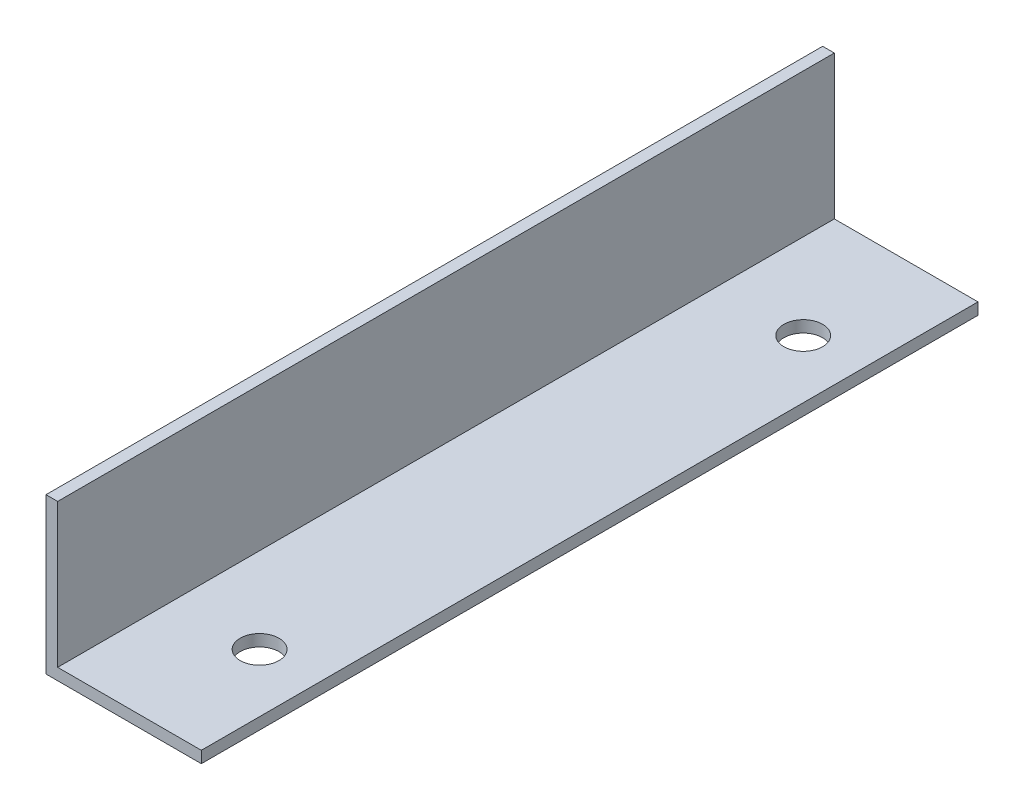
ISO-10303-21;
HEADER;
FILE_DESCRIPTION(('STEP AP214'),'2;1');
FILE_NAME('part.step','',(''),(''),'','','');
FILE_SCHEMA(('AUTOMOTIVE_DESIGN { 1 0 10303 214 1 1 1 1 }'));
ENDSEC;
DATA;
#1=APPLICATION_CONTEXT('core data for automotive mechanical design processes');
#2=APPLICATION_PROTOCOL_DEFINITION('international standard','automotive_design',2000,#1);
#3=PRODUCT_CONTEXT('',#1,'mechanical');
#4=PRODUCT('Part','Part','',(#3));
#5=PRODUCT_RELATED_PRODUCT_CATEGORY('part','',(#4));
#6=PRODUCT_DEFINITION_FORMATION('','',#4);
#7=PRODUCT_DEFINITION_CONTEXT('part definition',#1,'design');
#8=PRODUCT_DEFINITION('design','',#6,#7);
#9=PRODUCT_DEFINITION_SHAPE('','',#8);
#10=(LENGTH_UNIT() NAMED_UNIT(*) SI_UNIT(.MILLI.,.METRE.));
#11=(NAMED_UNIT(*) PLANE_ANGLE_UNIT() SI_UNIT($,.RADIAN.));
#12=(NAMED_UNIT(*) SI_UNIT($,.STERADIAN.) SOLID_ANGLE_UNIT());
#13=UNCERTAINTY_MEASURE_WITH_UNIT(LENGTH_MEASURE(1.E-05),#10,'distance_accuracy_value','');
#14=(GEOMETRIC_REPRESENTATION_CONTEXT(3) GLOBAL_UNCERTAINTY_ASSIGNED_CONTEXT((#13)) GLOBAL_UNIT_ASSIGNED_CONTEXT((#10,
#11,#12)) REPRESENTATION_CONTEXT('',''));
#15=CARTESIAN_POINT('',(0.,0.,0.));
#16=DIRECTION('',(0.,0.,1.));
#17=DIRECTION('',(1.,0.,0.));
#18=AXIS2_PLACEMENT_3D('',#15,#16,#17);
#19=CARTESIAN_POINT('',(40.,0.,200.));
#20=DIRECTION('',(0.,1.,0.));
#21=DIRECTION('',(0.,0.,1.));
#22=AXIS2_PLACEMENT_3D('',#19,#20,#21);
#23=PLANE('',#22);
#24=CARTESIAN_POINT('',(25.,0.,30.));
#25=DIRECTION('',(0.,1.,0.));
#26=DIRECTION('',(0.,0.,1.));
#27=AXIS2_PLACEMENT_3D('',#24,#25,#26);
#28=CIRCLE('',#27,5.);
#29=CARTESIAN_POINT('',(25.,0.,35.));
#30=VERTEX_POINT('',#29);
#31=EDGE_CURVE('E158',#30,#30,#28,.T.);
#32=ORIENTED_EDGE('',*,*,#31,.T.);
#33=EDGE_LOOP('',(#32));
#34=FACE_BOUND('',#33,.T.);
#35=CARTESIAN_POINT('',(25.,0.,170.));
#36=DIRECTION('',(0.,1.,0.));
#37=DIRECTION('',(0.,0.,1.));
#38=AXIS2_PLACEMENT_3D('',#35,#36,#37);
#39=CIRCLE('',#38,5.);
#40=CARTESIAN_POINT('',(25.,0.,175.));
#41=VERTEX_POINT('',#40);
#42=EDGE_CURVE('E94',#41,#41,#39,.T.);
#43=ORIENTED_EDGE('',*,*,#42,.T.);
#44=EDGE_LOOP('',(#43));
#45=FACE_BOUND('',#44,.T.);
#46=DIRECTION('',(1.,0.,0.));
#47=VECTOR('',#46,1.);
#48=CARTESIAN_POINT('',(40.,0.,0.));
#49=LINE('',#48,#47);
#50=CARTESIAN_POINT('',(0.,0.,0.));
#51=VERTEX_POINT('',#50);
#52=CARTESIAN_POINT('',(40.,0.,0.));
#53=VERTEX_POINT('',#52);
#54=EDGE_CURVE('E80',#51,#53,#49,.T.);
#55=ORIENTED_EDGE('',*,*,#54,.T.);
#56=DIRECTION('',(0.,0.,-1.));
#57=VECTOR('',#56,1.);
#58=CARTESIAN_POINT('',(40.,0.,200.));
#59=LINE('',#58,#57);
#60=CARTESIAN_POINT('',(40.,0.,200.));
#61=VERTEX_POINT('',#60);
#62=EDGE_CURVE('E11',#61,#53,#59,.T.);
#63=ORIENTED_EDGE('',*,*,#62,.F.);
#64=DIRECTION('',(1.,0.,0.));
#65=VECTOR('',#64,1.);
#66=CARTESIAN_POINT('',(40.,0.,200.));
#67=LINE('',#66,#65);
#68=CARTESIAN_POINT('',(0.,0.,200.));
#69=VERTEX_POINT('',#68);
#70=EDGE_CURVE('E108',#69,#61,#67,.T.);
#71=ORIENTED_EDGE('',*,*,#70,.F.);
#72=DIRECTION('',(0.,0.,-1.));
#73=VECTOR('',#72,1.);
#74=CARTESIAN_POINT('',(0.,0.,200.));
#75=LINE('',#74,#73);
#76=EDGE_CURVE('E93',#69,#51,#75,.T.);
#77=ORIENTED_EDGE('',*,*,#76,.T.);
#78=EDGE_LOOP('',(#55,#63,#71,#77));
#79=FACE_BOUND('',#78,.T.);
#80=ADVANCED_FACE('F24',(#34,#45,#79),#23,.F.);
#81=CARTESIAN_POINT('',(40.,3.,200.));
#82=DIRECTION('',(-1.,0.,0.));
#83=DIRECTION('',(0.,-1.,0.));
#84=AXIS2_PLACEMENT_3D('',#81,#82,#83);
#85=PLANE('',#84);
#86=DIRECTION('',(0.,1.,0.));
#87=VECTOR('',#86,1.);
#88=CARTESIAN_POINT('',(40.,3.,0.));
#89=LINE('',#88,#87);
#90=CARTESIAN_POINT('',(40.,3.,0.));
#91=VERTEX_POINT('',#90);
#92=EDGE_CURVE('E76',#53,#91,#89,.T.);
#93=ORIENTED_EDGE('',*,*,#92,.T.);
#94=DIRECTION('',(0.,0.,-1.));
#95=VECTOR('',#94,1.);
#96=CARTESIAN_POINT('',(40.,3.,200.));
#97=LINE('',#96,#95);
#98=CARTESIAN_POINT('',(40.,3.,200.));
#99=VERTEX_POINT('',#98);
#100=EDGE_CURVE('E31',#99,#91,#97,.T.);
#101=ORIENTED_EDGE('',*,*,#100,.F.);
#102=DIRECTION('',(0.,1.,0.));
#103=VECTOR('',#102,1.);
#104=CARTESIAN_POINT('',(40.,3.,200.));
#105=LINE('',#104,#103);
#106=EDGE_CURVE('E89',#61,#99,#105,.T.);
#107=ORIENTED_EDGE('',*,*,#106,.F.);
#108=ORIENTED_EDGE('',*,*,#62,.T.);
#109=EDGE_LOOP('',(#93,#101,#107,#108));
#110=FACE_BOUND('',#109,.T.);
#111=ADVANCED_FACE('F88',(#110),#85,.F.);
#112=CARTESIAN_POINT('',(3.00000000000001,3.,200.));
#113=DIRECTION('',(0.,-1.,0.));
#114=DIRECTION('',(0.,0.,-1.));
#115=AXIS2_PLACEMENT_3D('',#112,#113,#114);
#116=PLANE('',#115);
#117=CARTESIAN_POINT('',(25.,3.,30.));
#118=DIRECTION('',(0.,1.,0.));
#119=DIRECTION('',(0.,0.,1.));
#120=AXIS2_PLACEMENT_3D('',#117,#118,#119);
#121=CIRCLE('',#120,5.);
#122=CARTESIAN_POINT('',(25.,3.,35.));
#123=VERTEX_POINT('',#122);
#124=EDGE_CURVE('E169',#123,#123,#121,.T.);
#125=ORIENTED_EDGE('',*,*,#124,.F.);
#126=EDGE_LOOP('',(#125));
#127=FACE_BOUND('',#126,.T.);
#128=CARTESIAN_POINT('',(25.,3.,170.));
#129=DIRECTION('',(0.,1.,0.));
#130=DIRECTION('',(0.,0.,1.));
#131=AXIS2_PLACEMENT_3D('',#128,#129,#130);
#132=CIRCLE('',#131,5.);
#133=CARTESIAN_POINT('',(25.,3.,175.));
#134=VERTEX_POINT('',#133);
#135=EDGE_CURVE('E97',#134,#134,#132,.T.);
#136=ORIENTED_EDGE('',*,*,#135,.F.);
#137=EDGE_LOOP('',(#136));
#138=FACE_BOUND('',#137,.T.);
#139=DIRECTION('',(-1.,0.,0.));
#140=VECTOR('',#139,1.);
#141=CARTESIAN_POINT('',(3.00000000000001,3.,0.));
#142=LINE('',#141,#140);
#143=CARTESIAN_POINT('',(3.00000000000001,3.,0.));
#144=VERTEX_POINT('',#143);
#145=EDGE_CURVE('E82',#91,#144,#142,.T.);
#146=ORIENTED_EDGE('',*,*,#145,.T.);
#147=DIRECTION('',(0.,0.,-1.));
#148=VECTOR('',#147,1.);
#149=CARTESIAN_POINT('',(3.00000000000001,3.,200.));
#150=LINE('',#149,#148);
#151=CARTESIAN_POINT('',(3.00000000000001,3.,200.));
#152=VERTEX_POINT('',#151);
#153=EDGE_CURVE('E124',#152,#144,#150,.T.);
#154=ORIENTED_EDGE('',*,*,#153,.F.);
#155=DIRECTION('',(-1.,0.,0.));
#156=VECTOR('',#155,1.);
#157=CARTESIAN_POINT('',(3.00000000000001,3.,200.));
#158=LINE('',#157,#156);
#159=EDGE_CURVE('E111',#99,#152,#158,.T.);
#160=ORIENTED_EDGE('',*,*,#159,.F.);
#161=ORIENTED_EDGE('',*,*,#100,.T.);
#162=EDGE_LOOP('',(#146,#154,#160,#161));
#163=FACE_BOUND('',#162,.T.);
#164=ADVANCED_FACE('F128',(#127,#138,#163),#116,.F.);
#165=CARTESIAN_POINT('',(3.,40.,200.));
#166=DIRECTION('',(-1.,0.,0.));
#167=DIRECTION('',(0.,-1.,0.));
#168=AXIS2_PLACEMENT_3D('',#165,#166,#167);
#169=PLANE('',#168);
#170=DIRECTION('',(0.,1.,0.));
#171=VECTOR('',#170,1.);
#172=CARTESIAN_POINT('',(3.,40.,0.));
#173=LINE('',#172,#171);
#174=CARTESIAN_POINT('',(3.,40.,0.));
#175=VERTEX_POINT('',#174);
#176=EDGE_CURVE('E102',#144,#175,#173,.T.);
#177=ORIENTED_EDGE('',*,*,#176,.T.);
#178=DIRECTION('',(0.,0.,-1.));
#179=VECTOR('',#178,1.);
#180=CARTESIAN_POINT('',(3.,40.,200.));
#181=LINE('',#180,#179);
#182=CARTESIAN_POINT('',(3.,40.,200.));
#183=VERTEX_POINT('',#182);
#184=EDGE_CURVE('E121',#183,#175,#181,.T.);
#185=ORIENTED_EDGE('',*,*,#184,.F.);
#186=DIRECTION('',(0.,1.,0.));
#187=VECTOR('',#186,1.);
#188=CARTESIAN_POINT('',(3.,40.,200.));
#189=LINE('',#188,#187);
#190=EDGE_CURVE('E113',#152,#183,#189,.T.);
#191=ORIENTED_EDGE('',*,*,#190,.F.);
#192=ORIENTED_EDGE('',*,*,#153,.T.);
#193=EDGE_LOOP('',(#177,#185,#191,#192));
#194=FACE_BOUND('',#193,.T.);
#195=ADVANCED_FACE('F134',(#194),#169,.F.);
#196=CARTESIAN_POINT('',(0.,40.,200.));
#197=DIRECTION('',(0.,-1.,0.));
#198=DIRECTION('',(0.,0.,-1.));
#199=AXIS2_PLACEMENT_3D('',#196,#197,#198);
#200=PLANE('',#199);
#201=DIRECTION('',(-1.,0.,0.));
#202=VECTOR('',#201,1.);
#203=CARTESIAN_POINT('',(0.,40.,0.));
#204=LINE('',#203,#202);
#205=CARTESIAN_POINT('',(0.,40.,0.));
#206=VERTEX_POINT('',#205);
#207=EDGE_CURVE('E104',#175,#206,#204,.T.);
#208=ORIENTED_EDGE('',*,*,#207,.T.);
#209=DIRECTION('',(0.,0.,-1.));
#210=VECTOR('',#209,1.);
#211=CARTESIAN_POINT('',(0.,40.,200.));
#212=LINE('',#211,#210);
#213=CARTESIAN_POINT('',(0.,40.,200.));
#214=VERTEX_POINT('',#213);
#215=EDGE_CURVE('E118',#214,#206,#212,.T.);
#216=ORIENTED_EDGE('',*,*,#215,.F.);
#217=DIRECTION('',(-1.,0.,0.));
#218=VECTOR('',#217,1.);
#219=CARTESIAN_POINT('',(0.,40.,200.));
#220=LINE('',#219,#218);
#221=EDGE_CURVE('E43',#183,#214,#220,.T.);
#222=ORIENTED_EDGE('',*,*,#221,.F.);
#223=ORIENTED_EDGE('',*,*,#184,.T.);
#224=EDGE_LOOP('',(#208,#216,#222,#223));
#225=FACE_BOUND('',#224,.T.);
#226=ADVANCED_FACE('F137',(#225),#200,.F.);
#227=CARTESIAN_POINT('',(0.,0.,200.));
#228=DIRECTION('',(1.,0.,0.));
#229=DIRECTION('',(0.,0.,-1.));
#230=AXIS2_PLACEMENT_3D('',#227,#228,#229);
#231=PLANE('',#230);
#232=DIRECTION('',(0.,-1.,0.));
#233=VECTOR('',#232,1.);
#234=CARTESIAN_POINT('',(0.,0.,0.));
#235=LINE('',#234,#233);
#236=EDGE_CURVE('E106',#206,#51,#235,.T.);
#237=ORIENTED_EDGE('',*,*,#236,.T.);
#238=ORIENTED_EDGE('',*,*,#76,.F.);
#239=DIRECTION('',(0.,-1.,0.));
#240=VECTOR('',#239,1.);
#241=CARTESIAN_POINT('',(0.,0.,200.));
#242=LINE('',#241,#240);
#243=EDGE_CURVE('E38',#214,#69,#242,.T.);
#244=ORIENTED_EDGE('',*,*,#243,.F.);
#245=ORIENTED_EDGE('',*,*,#215,.T.);
#246=EDGE_LOOP('',(#237,#238,#244,#245));
#247=FACE_BOUND('',#246,.T.);
#248=ADVANCED_FACE('F139',(#247),#231,.F.);
#249=CARTESIAN_POINT('',(0.,0.,200.));
#250=DIRECTION('',(0.,0.,-1.));
#251=DIRECTION('',(-1.,0.,0.));
#252=AXIS2_PLACEMENT_3D('',#249,#250,#251);
#253=PLANE('',#252);
#254=ORIENTED_EDGE('',*,*,#70,.T.);
#255=ORIENTED_EDGE('',*,*,#106,.T.);
#256=ORIENTED_EDGE('',*,*,#159,.T.);
#257=ORIENTED_EDGE('',*,*,#190,.T.);
#258=ORIENTED_EDGE('',*,*,#221,.T.);
#259=ORIENTED_EDGE('',*,*,#243,.T.);
#260=EDGE_LOOP('',(#254,#255,#256,#257,#258,#259));
#261=FACE_BOUND('',#260,.T.);
#262=ADVANCED_FACE('F131',(#261),#253,.F.);
#263=CARTESIAN_POINT('',(0.,0.,0.));
#264=DIRECTION('',(0.,0.,-1.));
#265=DIRECTION('',(-1.,0.,0.));
#266=AXIS2_PLACEMENT_3D('',#263,#264,#265);
#267=PLANE('',#266);
#268=ORIENTED_EDGE('',*,*,#54,.F.);
#269=ORIENTED_EDGE('',*,*,#236,.F.);
#270=ORIENTED_EDGE('',*,*,#207,.F.);
#271=ORIENTED_EDGE('',*,*,#176,.F.);
#272=ORIENTED_EDGE('',*,*,#145,.F.);
#273=ORIENTED_EDGE('',*,*,#92,.F.);
#274=EDGE_LOOP('',(#268,#269,#270,#271,#272,#273));
#275=FACE_BOUND('',#274,.T.);
#276=ADVANCED_FACE('F77',(#275),#267,.T.);
#277=CARTESIAN_POINT('',(25.,0.,170.));
#278=DIRECTION('',(0.,1.,0.));
#279=DIRECTION('',(0.,0.,1.));
#280=AXIS2_PLACEMENT_3D('',#277,#278,#279);
#281=CYLINDRICAL_SURFACE('',#280,5.);
#282=ORIENTED_EDGE('',*,*,#42,.F.);
#283=EDGE_LOOP('',(#282));
#284=FACE_BOUND('',#283,.T.);
#285=ORIENTED_EDGE('',*,*,#135,.T.);
#286=EDGE_LOOP('',(#285));
#287=FACE_BOUND('',#286,.T.);
#288=ADVANCED_FACE('F161',(#284,#287),#281,.F.);
#289=CARTESIAN_POINT('',(25.,0.,30.));
#290=DIRECTION('',(0.,1.,0.));
#291=DIRECTION('',(0.,0.,1.));
#292=AXIS2_PLACEMENT_3D('',#289,#290,#291);
#293=CYLINDRICAL_SURFACE('',#292,5.);
#294=ORIENTED_EDGE('',*,*,#31,.F.);
#295=EDGE_LOOP('',(#294));
#296=FACE_BOUND('',#295,.T.);
#297=ORIENTED_EDGE('',*,*,#124,.T.);
#298=EDGE_LOOP('',(#297));
#299=FACE_BOUND('',#298,.T.);
#300=ADVANCED_FACE('F164',(#296,#299),#293,.F.);
#301=CLOSED_SHELL('',(#80,#111,#164,#195,#226,#248,#262,#276,#288,#300));
#302=MANIFOLD_SOLID_BREP('B2',#301);
#303=ADVANCED_BREP_SHAPE_REPRESENTATION('',(#18,#302),#14);
#304=SHAPE_DEFINITION_REPRESENTATION(#9,#303);
ENDSEC;
END-ISO-10303-21;
